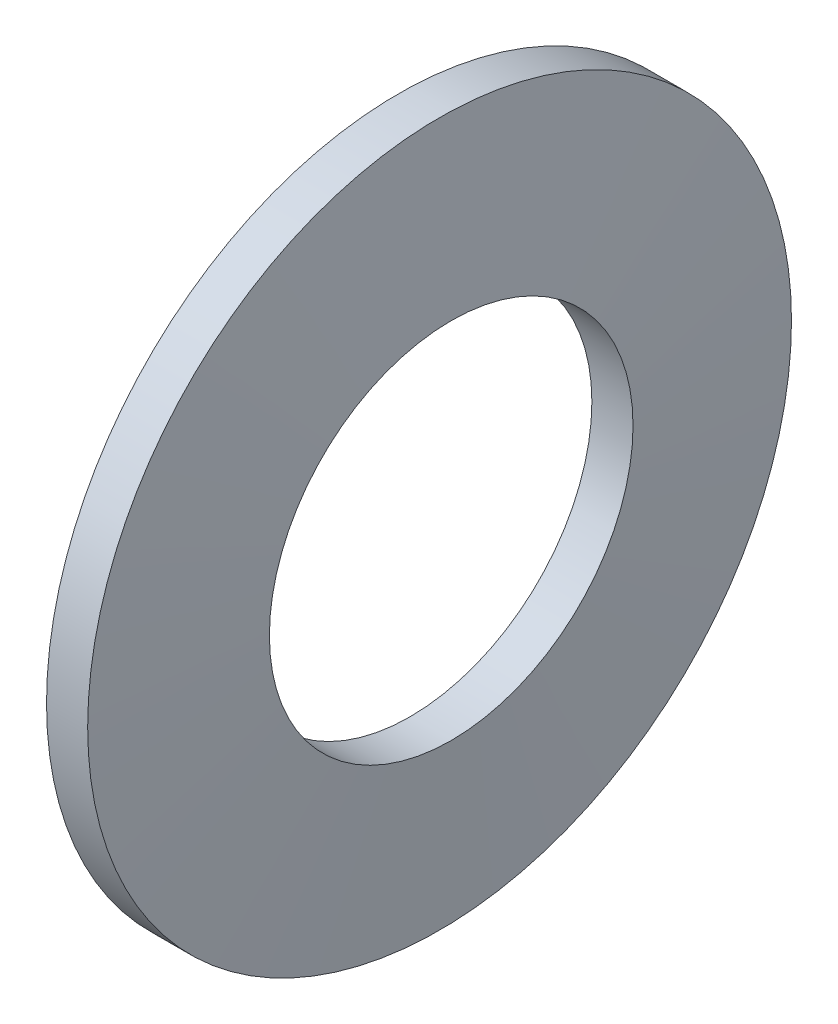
ISO-10303-21;
HEADER;
FILE_DESCRIPTION(('STEP AP214'),'2;1');
FILE_NAME('part.step','',(''),(''),'','','');
FILE_SCHEMA(('AUTOMOTIVE_DESIGN { 1 0 10303 214 1 1 1 1 }'));
ENDSEC;
DATA;
#1=APPLICATION_CONTEXT('core data for automotive mechanical design processes');
#2=APPLICATION_PROTOCOL_DEFINITION('international standard','automotive_design',2000,#1);
#3=PRODUCT_CONTEXT('',#1,'mechanical');
#4=PRODUCT('Part','Part','',(#3));
#5=PRODUCT_RELATED_PRODUCT_CATEGORY('part','',(#4));
#6=PRODUCT_DEFINITION_FORMATION('','',#4);
#7=PRODUCT_DEFINITION_CONTEXT('part definition',#1,'design');
#8=PRODUCT_DEFINITION('design','',#6,#7);
#9=PRODUCT_DEFINITION_SHAPE('','',#8);
#10=(LENGTH_UNIT() NAMED_UNIT(*) SI_UNIT(.MILLI.,.METRE.));
#11=(NAMED_UNIT(*) PLANE_ANGLE_UNIT() SI_UNIT($,.RADIAN.));
#12=(NAMED_UNIT(*) SI_UNIT($,.STERADIAN.) SOLID_ANGLE_UNIT());
#13=UNCERTAINTY_MEASURE_WITH_UNIT(LENGTH_MEASURE(1.E-05),#10,'distance_accuracy_value','');
#14=(GEOMETRIC_REPRESENTATION_CONTEXT(3) GLOBAL_UNCERTAINTY_ASSIGNED_CONTEXT((#13)) GLOBAL_UNIT_ASSIGNED_CONTEXT((#10,
#11,#12)) REPRESENTATION_CONTEXT('',''));
#15=CARTESIAN_POINT('',(0.,0.,0.));
#16=DIRECTION('',(0.,0.,1.));
#17=DIRECTION('',(1.,0.,0.));
#18=AXIS2_PLACEMENT_3D('',#15,#16,#17);
#19=CARTESIAN_POINT('',(0.,0.,0.));
#20=DIRECTION('',(-1.,0.,0.));
#21=DIRECTION('',(0.,0.,1.));
#22=AXIS2_PLACEMENT_3D('',#19,#20,#21);
#23=CONICAL_SURFACE('',#22,30.,1.50250120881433);
#24=CARTESIAN_POINT('',(0.991821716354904,0.,0.));
#25=DIRECTION('',(-1.,0.,0.));
#26=DIRECTION('',(0.,0.,1.));
#27=AXIS2_PLACEMENT_3D('',#24,#25,#26);
#28=CIRCLE('',#27,15.5);
#29=CARTESIAN_POINT('',(0.991821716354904,0.,15.5));
#30=VERTEX_POINT('',#29);
#31=EDGE_CURVE('E48',#30,#30,#28,.T.);
#32=ORIENTED_EDGE('',*,*,#31,.F.);
#33=EDGE_LOOP('',(#32));
#34=FACE_BOUND('',#33,.T.);
#35=CARTESIAN_POINT('',(0.,0.,0.));
#36=DIRECTION('',(-1.,0.,0.));
#37=DIRECTION('',(0.,0.,1.));
#38=AXIS2_PLACEMENT_3D('',#35,#36,#37);
#39=CIRCLE('',#38,30.);
#40=CARTESIAN_POINT('',(0.,0.,30.));
#41=VERTEX_POINT('',#40);
#42=EDGE_CURVE('E10',#41,#41,#39,.T.);
#43=ORIENTED_EDGE('',*,*,#42,.T.);
#44=EDGE_LOOP('',(#43));
#45=FACE_BOUND('',#44,.T.);
#46=ADVANCED_FACE('F34',(#34,#45),#23,.F.);
#47=CARTESIAN_POINT('',(0.,0.,0.));
#48=DIRECTION('',(-1.,0.,0.));
#49=DIRECTION('',(0.,0.,1.));
#50=AXIS2_PLACEMENT_3D('',#47,#48,#49);
#51=CYLINDRICAL_SURFACE('',#50,30.);
#52=ORIENTED_EDGE('',*,*,#42,.F.);
#53=EDGE_LOOP('',(#52));
#54=FACE_BOUND('',#53,.T.);
#55=CARTESIAN_POINT('',(3.5081782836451,0.,0.));
#56=DIRECTION('',(-1.,0.,0.));
#57=DIRECTION('',(0.,0.,1.));
#58=AXIS2_PLACEMENT_3D('',#55,#56,#57);
#59=CIRCLE('',#58,30.);
#60=CARTESIAN_POINT('',(3.5081782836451,0.,30.));
#61=VERTEX_POINT('',#60);
#62=EDGE_CURVE('E40',#61,#61,#59,.T.);
#63=ORIENTED_EDGE('',*,*,#62,.T.);
#64=EDGE_LOOP('',(#63));
#65=FACE_BOUND('',#64,.T.);
#66=ADVANCED_FACE('F57',(#54,#65),#51,.T.);
#67=CARTESIAN_POINT('',(4.5,0.,0.));
#68=DIRECTION('',(-1.,0.,0.));
#69=DIRECTION('',(0.,0.,1.));
#70=AXIS2_PLACEMENT_3D('',#67,#68,#69);
#71=CONICAL_SURFACE('',#70,15.5,1.50250120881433);
#72=ORIENTED_EDGE('',*,*,#62,.F.);
#73=EDGE_LOOP('',(#72));
#74=FACE_BOUND('',#73,.T.);
#75=CARTESIAN_POINT('',(4.5,0.,0.));
#76=DIRECTION('',(-1.,0.,0.));
#77=DIRECTION('',(0.,0.,1.));
#78=AXIS2_PLACEMENT_3D('',#75,#76,#77);
#79=CIRCLE('',#78,15.5);
#80=CARTESIAN_POINT('',(4.5,0.,15.5));
#81=VERTEX_POINT('',#80);
#82=EDGE_CURVE('E44',#81,#81,#79,.T.);
#83=ORIENTED_EDGE('',*,*,#82,.T.);
#84=EDGE_LOOP('',(#83));
#85=FACE_BOUND('',#84,.T.);
#86=ADVANCED_FACE('F61',(#74,#85),#71,.T.);
#87=CARTESIAN_POINT('',(0.,0.,0.));
#88=DIRECTION('',(-1.,0.,0.));
#89=DIRECTION('',(0.,0.,1.));
#90=AXIS2_PLACEMENT_3D('',#87,#88,#89);
#91=CYLINDRICAL_SURFACE('',#90,15.5);
#92=ORIENTED_EDGE('',*,*,#82,.F.);
#93=EDGE_LOOP('',(#92));
#94=FACE_BOUND('',#93,.T.);
#95=ORIENTED_EDGE('',*,*,#31,.T.);
#96=EDGE_LOOP('',(#95));
#97=FACE_BOUND('',#96,.T.);
#98=ADVANCED_FACE('F54',(#94,#97),#91,.F.);
#99=CLOSED_SHELL('',(#46,#66,#86,#98));
#100=MANIFOLD_SOLID_BREP('B2',#99);
#101=ADVANCED_BREP_SHAPE_REPRESENTATION('',(#18,#100),#14);
#102=SHAPE_DEFINITION_REPRESENTATION(#9,#101);
ENDSEC;
END-ISO-10303-21;
